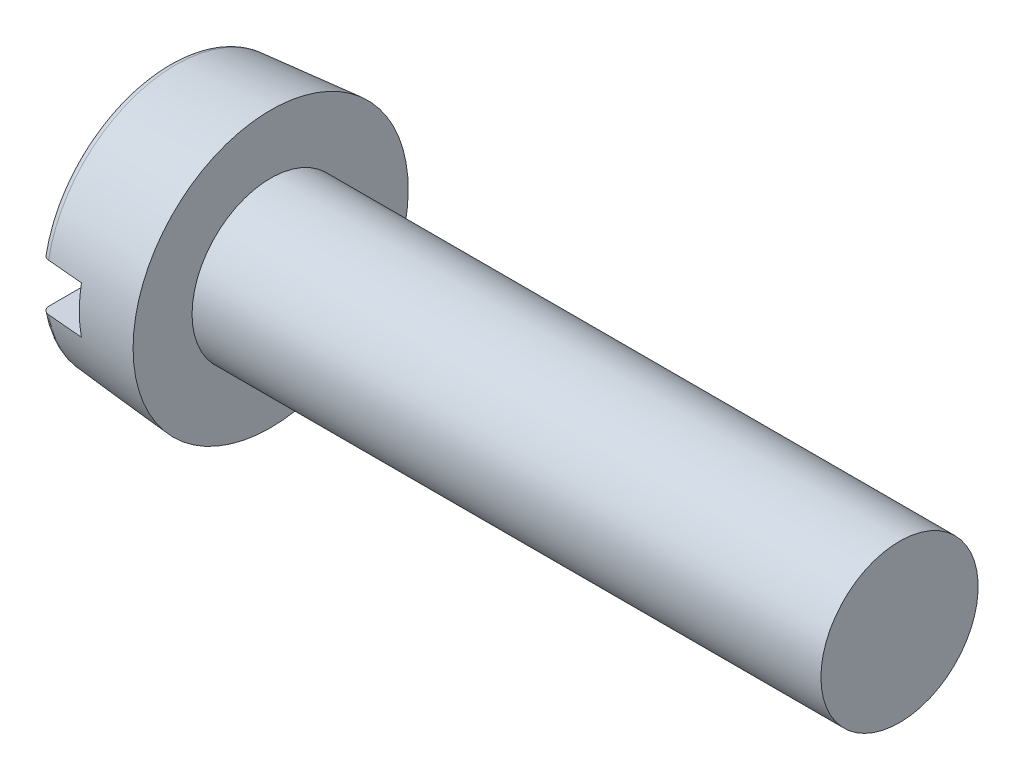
from build123d import *

# Parameters (mm, degrees)
FILLET2_R  = 0.2
SKETCH2_W  = 7
SKETCH2_H  = 1.2
SLOT_DEPTH = 1.1


with BuildPart() as part:
    # BodySke → Base-Revolve (revolve)
    with BuildSketch(Plane.XY, mode=Mode.PRIVATE) as base_revolve_sk:
        Polygon((2.6, 2), (2.6, 3.5), (0, 3.272529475), (0, 0), (18.6, 0), (18.6, 2), align=None)
    revolve(base_revolve_sk.sketch.rotate(Axis((-25.4, 0, 0), (1, 0, 0)), 90), axis=Axis((-25.4, 0, 0), (1, 0, 0)))

    # Fillet2
    fillet2_edges = [part.edges().sort_by_distance(p)[0] for p in [
        (0, 0, -3.272529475),
    ]]
    fillet(fillet2_edges, radius=FILLET2_R)

    # Sketch2 → Slot (cut)
    with BuildSketch(Plane(origin=(0, 0, 0), x_dir=(0, 0, -1), z_dir=(1, 0, 0))):
        Rectangle(SKETCH2_W, SKETCH2_H)
    extrude(amount=SLOT_DEPTH, mode=Mode.SUBTRACT)


solid = part.part
